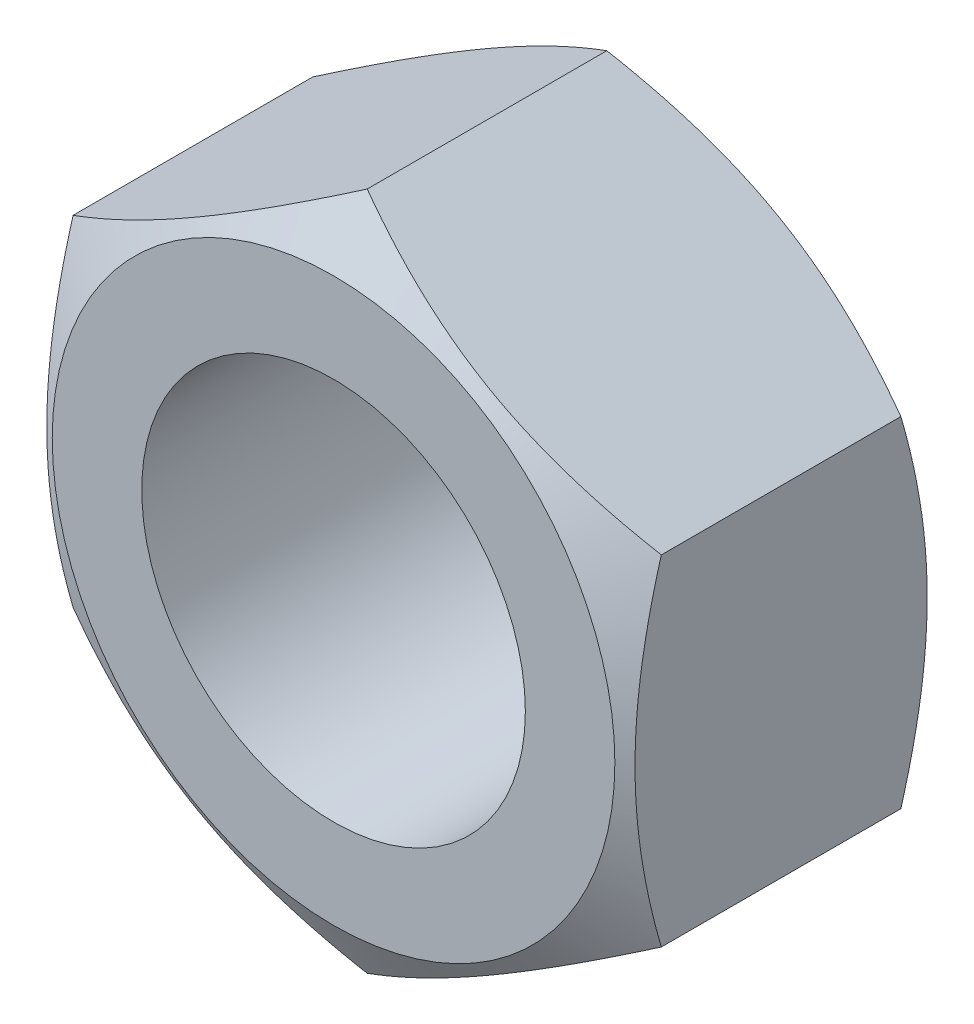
ISO-10303-21;
HEADER;
FILE_DESCRIPTION(('STEP AP214'),'2;1');
FILE_NAME('part.step','',(''),(''),'','','');
FILE_SCHEMA(('AUTOMOTIVE_DESIGN { 1 0 10303 214 1 1 1 1 }'));
ENDSEC;
DATA;
#1=APPLICATION_CONTEXT('core data for automotive mechanical design processes');
#2=APPLICATION_PROTOCOL_DEFINITION('international standard','automotive_design',2000,#1);
#3=PRODUCT_CONTEXT('',#1,'mechanical');
#4=PRODUCT('Part','Part','',(#3));
#5=PRODUCT_RELATED_PRODUCT_CATEGORY('part','',(#4));
#6=PRODUCT_DEFINITION_FORMATION('','',#4);
#7=PRODUCT_DEFINITION_CONTEXT('part definition',#1,'design');
#8=PRODUCT_DEFINITION('design','',#6,#7);
#9=PRODUCT_DEFINITION_SHAPE('','',#8);
#10=(LENGTH_UNIT() NAMED_UNIT(*) SI_UNIT(.MILLI.,.METRE.));
#11=(NAMED_UNIT(*) PLANE_ANGLE_UNIT() SI_UNIT($,.RADIAN.));
#12=(NAMED_UNIT(*) SI_UNIT($,.STERADIAN.) SOLID_ANGLE_UNIT());
#13=UNCERTAINTY_MEASURE_WITH_UNIT(LENGTH_MEASURE(1.E-05),#10,'distance_accuracy_value','');
#14=(GEOMETRIC_REPRESENTATION_CONTEXT(3) GLOBAL_UNCERTAINTY_ASSIGNED_CONTEXT((#13)) GLOBAL_UNIT_ASSIGNED_CONTEXT((#10,
#11,#12)) REPRESENTATION_CONTEXT('',''));
#15=CARTESIAN_POINT('',(0.,0.,0.));
#16=DIRECTION('',(0.,0.,1.));
#17=DIRECTION('',(1.,0.,0.));
#18=AXIS2_PLACEMENT_3D('',#15,#16,#17);
#19=CARTESIAN_POINT('',(23.,13.2790561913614,18.));
#20=DIRECTION('',(-0.5,-0.866025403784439,0.));
#21=DIRECTION('',(0.866025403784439,-0.5,0.));
#22=AXIS2_PLACEMENT_3D('',#19,#20,#21);
#23=PLANE('',#22);
#24=CARTESIAN_POINT('',(23.0002,13.2789407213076,21.368305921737));
#25=CARTESIAN_POINT('',(22.4946699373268,13.5708086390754,21.5368037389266));
#26=CARTESIAN_POINT('',(21.9871680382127,13.8638149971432,21.697655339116));
#27=CARTESIAN_POINT('',(20.9680946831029,14.4521772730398,22.0019407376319));
#28=CARTESIAN_POINT('',(20.4565219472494,14.7475339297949,22.1453688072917));
#29=CARTESIAN_POINT('',(19.4283073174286,15.3411739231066,22.4128820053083));
#30=CARTESIAN_POINT('',(18.9116563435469,15.6394625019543,22.5369209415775));
#31=CARTESIAN_POINT('',(17.874786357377,16.2380996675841,22.7629837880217));
#32=CARTESIAN_POINT('',(17.3545677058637,16.5384480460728,22.8650098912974));
#33=CARTESIAN_POINT('',(16.3238595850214,17.133527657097,23.0427162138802));
#34=CARTESIAN_POINT('',(15.8134465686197,17.4282147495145,23.1189841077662));
#35=CARTESIAN_POINT('',(14.7902817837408,18.0189392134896,23.2468679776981));
#36=CARTESIAN_POINT('',(14.2775299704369,18.3149766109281,23.2984834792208));
#37=CARTESIAN_POINT('',(13.2511650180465,18.9075486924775,23.3757592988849));
#38=CARTESIAN_POINT('',(12.737553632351,19.2040823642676,23.4014504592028));
#39=CARTESIAN_POINT('',(11.709856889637,19.7974233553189,23.4263251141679));
#40=CARTESIAN_POINT('',(11.1957715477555,20.0942306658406,23.4255094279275));
#41=CARTESIAN_POINT('',(10.2346805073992,20.649116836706,23.3992217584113));
#42=CARTESIAN_POINT('',(9.78760635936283,20.9072352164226,23.3769553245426));
#43=CARTESIAN_POINT('',(8.89452539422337,21.422855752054,23.3127980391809));
#44=CARTESIAN_POINT('',(8.44851856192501,21.6803579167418,23.2709074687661));
#45=CARTESIAN_POINT('',(7.55773701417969,22.1946508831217,23.1682279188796));
#46=CARTESIAN_POINT('',(7.11296378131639,22.4514408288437,23.1074218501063));
#47=CARTESIAN_POINT('',(6.22554696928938,22.9637911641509,22.9679874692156));
#48=CARTESIAN_POINT('',(5.78290338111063,23.219351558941,22.8893592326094));
#49=CARTESIAN_POINT('',(4.43913170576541,23.9951784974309,22.6247233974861));
#50=CARTESIAN_POINT('',(3.54182151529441,24.513240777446,22.4123142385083));
#51=CARTESIAN_POINT('',(2.20576568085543,25.2846129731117,22.050697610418));
#52=CARTESIAN_POINT('',(1.76244815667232,25.5405624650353,21.9231217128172));
#53=CARTESIAN_POINT('',(0.878879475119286,26.0506910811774,21.6550544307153));
#54=CARTESIAN_POINT('',(0.438627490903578,26.3048706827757,21.5145666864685));
#55=CARTESIAN_POINT('',(-0.000200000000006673,26.5582278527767,21.368305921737));
#56=B_SPLINE_CURVE_WITH_KNOTS('',3,(#24,#25,#26,#27,#28,#29,#30,#31,#32,#33,#34,#35,#36,#37,#38,
#39,#40,#41,#42,#43,#44,#45,#46,#47,#48,#49,#50,#51,#52,#53,#54,#55),.UNSPECIFIED.,.F.,.F.,(4,2,
2,2,2,2,2,2,2,2,2,2,2,2,2,4),(0.,1.82275209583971,3.64610187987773,5.47373144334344,
7.30117883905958,9.08355891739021,10.8659733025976,12.6462646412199,14.4265009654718,
15.9762768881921,17.5260306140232,19.0771885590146,20.6283399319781,23.7989683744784,
25.381520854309,26.9636285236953),.UNSPECIFIED.);
#57=CARTESIAN_POINT('',(23.,13.2790561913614,21.3683725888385));
#58=VERTEX_POINT('',#57);
#59=CARTESIAN_POINT('',(0.,26.5581123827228,21.3683725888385));
#60=VERTEX_POINT('',#59);
#61=EDGE_CURVE('E74',#58,#60,#56,.T.);
#62=ORIENTED_EDGE('',*,*,#61,.F.);
#63=DIRECTION('',(0.,0.,-1.));
#64=VECTOR('',#63,1.);
#65=CARTESIAN_POINT('',(23.,13.2790561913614,18.));
#66=LINE('',#65,#64);
#67=CARTESIAN_POINT('',(23.,13.2790561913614,2.63162741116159));
#68=VERTEX_POINT('',#67);
#69=EDGE_CURVE('E43',#58,#68,#66,.T.);
#70=ORIENTED_EDGE('',*,*,#69,.T.);
#71=CARTESIAN_POINT('',(41.5855022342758,2.54871147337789,11.3527456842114));
#72=CARTESIAN_POINT('',(41.1450502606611,2.80300653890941,11.1079162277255));
#73=CARTESIAN_POINT('',(40.7040475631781,3.05761956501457,10.8644035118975));
#74=CARTESIAN_POINT('',(39.8208235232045,3.56754920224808,10.3803276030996));
#75=CARTESIAN_POINT('',(39.3786021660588,3.82286582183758,10.1397644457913));
#76=CARTESIAN_POINT('',(38.4927512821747,4.33431206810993,9.66186486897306));
#77=CARTESIAN_POINT('',(38.0491215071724,4.59044183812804,9.42452906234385));
#78=CARTESIAN_POINT('',(37.1604115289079,5.10353878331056,8.95351300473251));
#79=CARTESIAN_POINT('',(36.7153313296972,5.36050595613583,8.71983274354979));
#80=CARTESIAN_POINT('',(35.372054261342,6.13604733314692,8.02195758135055));
#81=CARTESIAN_POINT('',(34.4714270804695,6.65602467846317,7.5639652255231));
#82=CARTESIAN_POINT('',(32.6624925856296,7.70041349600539,6.66876168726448));
#83=CARTESIAN_POINT('',(31.75418571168,8.22482471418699,6.23154932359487));
#84=CARTESIAN_POINT('',(29.9202973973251,9.2836206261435,5.37984431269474));
#85=CARTESIAN_POINT('',(28.9946343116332,9.8180524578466,4.96558472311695));
#86=CARTESIAN_POINT('',(27.1320311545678,10.8934268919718,4.17164593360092));
#87=CARTESIAN_POINT('',(26.1950897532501,11.4343702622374,3.79197085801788));
#88=CARTESIAN_POINT('',(24.3106706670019,12.5223401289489,3.07821746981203));
#89=CARTESIAN_POINT('',(23.3632239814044,13.0693487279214,2.74403099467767));
#90=CARTESIAN_POINT('',(21.454635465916,14.1712728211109,2.13286972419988));
#91=CARTESIAN_POINT('',(20.4934985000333,14.7261855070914,1.85587512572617));
#92=CARTESIAN_POINT('',(19.0482059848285,15.5606255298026,1.49577894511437));
#93=CARTESIAN_POINT('',(18.5690812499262,15.8372483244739,1.38554003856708));
#94=CARTESIAN_POINT('',(17.6077970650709,16.3922460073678,1.18429026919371));
#95=CARTESIAN_POINT('',(17.1256376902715,16.6706208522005,1.09327893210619));
#96=CARTESIAN_POINT('',(16.158656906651,17.228907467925,0.932140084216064));
#97=CARTESIAN_POINT('',(15.673835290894,17.5088193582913,0.862014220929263));
#98=CARTESIAN_POINT('',(14.7021451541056,18.0698249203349,0.744079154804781));
#99=CARTESIAN_POINT('',(14.2152766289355,18.3509185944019,0.696269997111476));
#100=CARTESIAN_POINT('',(13.2429233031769,18.9123070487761,0.624219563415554));
#101=CARTESIAN_POINT('',(12.7574456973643,19.1925976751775,0.599849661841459));
#102=CARTESIAN_POINT('',(11.7860363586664,19.7534411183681,0.574777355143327));
#103=CARTESIAN_POINT('',(11.300104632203,20.0339939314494,0.574074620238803));
#104=CARTESIAN_POINT('',(10.3287659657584,20.5947965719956,0.596351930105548));
#105=CARTESIAN_POINT('',(9.84335892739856,20.8750464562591,0.619326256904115));
#106=CARTESIAN_POINT('',(8.87377970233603,21.4348332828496,0.68841563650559));
#107=CARTESIAN_POINT('',(8.38960757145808,21.7143701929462,0.734531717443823));
#108=CARTESIAN_POINT('',(7.19256304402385,22.4054841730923,0.876233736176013));
#109=CARTESIAN_POINT('',(6.48083681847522,22.8163995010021,0.98492575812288));
#110=CARTESIAN_POINT('',(5.06341935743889,23.6347458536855,1.24605374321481));
#111=CARTESIAN_POINT('',(4.35772914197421,24.0421762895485,1.39849695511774));
#112=CARTESIAN_POINT('',(2.95186459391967,24.8538525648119,1.74192763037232));
#113=CARTESIAN_POINT('',(2.2517057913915,25.2580894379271,1.93299906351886));
#114=CARTESIAN_POINT('',(0.858781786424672,26.0622944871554,2.34779891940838));
#115=CARTESIAN_POINT('',(0.166016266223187,26.462262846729,2.57152593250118));
#116=CARTESIAN_POINT('',(-1.2274955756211,27.2668072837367,3.05160724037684));
#117=CARTESIAN_POINT('',(-1.92808377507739,27.6712920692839,3.30856942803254));
#118=CARTESIAN_POINT('',(-3.32240533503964,28.476303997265,3.84627513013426));
#119=CARTESIAN_POINT('',(-4.01613810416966,28.8768307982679,4.1270206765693));
#120=CARTESIAN_POINT('',(-5.39338581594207,29.6719851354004,4.70650160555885));
#121=CARTESIAN_POINT('',(-6.0769366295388,30.0666333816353,5.00512373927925));
#122=CARTESIAN_POINT('',(-7.09804291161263,30.6561693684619,5.46510621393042));
#123=CARTESIAN_POINT('',(-7.43765669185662,30.8522454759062,5.62041722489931));
#124=CARTESIAN_POINT('',(-8.11559292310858,31.2436521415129,5.93472462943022));
#125=CARTESIAN_POINT('',(-8.45391540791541,31.4389827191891,6.093720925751));
#126=CARTESIAN_POINT('',(-8.79164107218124,31.6339687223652,6.2543918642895));
#127=B_SPLINE_CURVE_WITH_KNOTS('',3,(#71,#72,#73,#74,#75,#76,#77,#78,#79,#80,#81,#82,#83,#84,
#85,#86,#87,#88,#89,#90,#91,#92,#93,#94,#95,#96,#97,#98,#99,#100,#101,#102,#103,#104,#105,#106,
#107,#108,#109,#110,#111,#112,#113,#114,#115,#116,#117,#118,#119,#120,#121,#122,#123,#124,#125,
#126),.UNSPECIFIED.,.F.,.F.,(4,2,2,2,2,2,2,2,2,2,2,2,2,2,2,2,2,2,2,2,2,2,2,2,2,2,2,4),(0.,
1.69335491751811,3.38673028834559,5.08042286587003,6.7741107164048,10.1829354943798,
13.5915662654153,17.0301107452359,20.4690647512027,23.8996931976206,27.3291317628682,
29.0212168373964,30.71326017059,32.4054369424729,34.0976171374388,35.7804574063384,
37.4632742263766,39.1456847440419,40.8281700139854,43.313727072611,45.7996961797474,
48.2911285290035,50.7824533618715,53.3284099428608,55.8745842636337,58.4060550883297,
59.6714032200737,60.9367180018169),.UNSPECIFIED.);
#128=CARTESIAN_POINT('',(0.,26.5581123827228,2.63162741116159));
#129=VERTEX_POINT('',#128);
#130=EDGE_CURVE('E92',#129,#68,#127,.F.);
#131=ORIENTED_EDGE('',*,*,#130,.F.);
#132=DIRECTION('',(0.,0.,-1.));
#133=VECTOR('',#132,1.);
#134=CARTESIAN_POINT('',(0.,26.5581123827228,18.));
#135=LINE('',#134,#133);
#136=EDGE_CURVE('E28',#60,#129,#135,.T.);
#137=ORIENTED_EDGE('',*,*,#136,.F.);
#138=EDGE_LOOP('',(#62,#70,#131,#137));
#139=FACE_BOUND('',#138,.T.);
#140=ADVANCED_FACE('F14',(#139),#23,.F.);
#141=CARTESIAN_POINT('',(0.,26.5581123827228,18.));
#142=DIRECTION('',(0.5,-0.866025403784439,0.));
#143=DIRECTION('',(0.866025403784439,0.5,0.));
#144=AXIS2_PLACEMENT_3D('',#141,#142,#143);
#145=PLANE('',#144);
#146=CARTESIAN_POINT('',(0.000199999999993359,26.5582278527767,21.368305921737));
#147=CARTESIAN_POINT('',(-0.505330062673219,26.2663599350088,21.5368037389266));
#148=CARTESIAN_POINT('',(-1.01283196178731,25.973353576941,21.697655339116));
#149=CARTESIAN_POINT('',(-2.03190531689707,25.3849913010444,22.0019407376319));
#150=CARTESIAN_POINT('',(-2.54347805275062,25.0896346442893,22.1453688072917));
#151=CARTESIAN_POINT('',(-3.57169268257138,24.4959946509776,22.4128820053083));
#152=CARTESIAN_POINT('',(-4.08834365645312,24.1977060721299,22.5369209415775));
#153=CARTESIAN_POINT('',(-5.12521364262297,23.5990689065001,22.7629837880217));
#154=CARTESIAN_POINT('',(-5.64543229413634,23.2987205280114,22.8650098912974));
#155=CARTESIAN_POINT('',(-6.6761404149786,22.7036409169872,23.0427162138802));
#156=CARTESIAN_POINT('',(-7.18655343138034,22.4089538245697,23.1189841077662));
#157=CARTESIAN_POINT('',(-8.20971821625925,21.8182293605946,23.2468679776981));
#158=CARTESIAN_POINT('',(-8.72247002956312,21.5221919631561,23.2984834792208));
#159=CARTESIAN_POINT('',(-9.74883498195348,20.9296198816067,23.3757592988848));
#160=CARTESIAN_POINT('',(-10.262446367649,20.6330862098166,23.4014504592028));
#161=CARTESIAN_POINT('',(-11.290143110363,20.0397452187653,23.4263251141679));
#162=CARTESIAN_POINT('',(-11.8042284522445,19.7429379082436,23.4255094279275));
#163=CARTESIAN_POINT('',(-12.7653194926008,19.1880517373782,23.3992217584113));
#164=CARTESIAN_POINT('',(-13.2123936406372,18.9299333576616,23.3769553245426));
#165=CARTESIAN_POINT('',(-14.1054746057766,18.4143128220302,23.3127980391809));
#166=CARTESIAN_POINT('',(-14.551481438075,18.1568106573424,23.2709074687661));
#167=CARTESIAN_POINT('',(-15.4422629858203,17.6425176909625,23.1682279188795));
#168=CARTESIAN_POINT('',(-15.8870362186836,17.3857277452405,23.1074218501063));
#169=CARTESIAN_POINT('',(-16.7744530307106,16.8733774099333,22.9679874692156));
#170=CARTESIAN_POINT('',(-17.2170966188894,16.6178170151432,22.8893592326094));
#171=CARTESIAN_POINT('',(-18.5608682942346,15.8419900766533,22.6247233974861));
#172=CARTESIAN_POINT('',(-19.4581784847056,15.3239277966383,22.4123142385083));
#173=CARTESIAN_POINT('',(-20.7942343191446,14.5525556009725,22.050697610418));
#174=CARTESIAN_POINT('',(-21.2375518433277,14.2966061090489,21.9231217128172));
#175=CARTESIAN_POINT('',(-22.1211205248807,13.7864774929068,21.6550544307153));
#176=CARTESIAN_POINT('',(-22.5613725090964,13.5322978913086,21.5145666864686));
#177=CARTESIAN_POINT('',(-23.0002,13.2789407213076,21.368305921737));
#178=B_SPLINE_CURVE_WITH_KNOTS('',3,(#146,#147,#148,#149,#150,#151,#152,#153,#154,#155,#156,
#157,#158,#159,#160,#161,#162,#163,#164,#165,#166,#167,#168,#169,#170,#171,#172,#173,#174,#175,
#176,#177),.UNSPECIFIED.,.F.,.F.,(4,2,2,2,2,2,2,2,2,2,2,2,2,2,2,4),(0.,1.82275209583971,
3.64610187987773,5.47373144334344,7.30117883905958,9.08355891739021,10.8659733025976,
12.6462646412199,14.4265009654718,15.9762768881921,17.5260306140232,19.0771885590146,
20.6283399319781,23.7989683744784,25.381520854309,26.9636285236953),.UNSPECIFIED.);
#179=CARTESIAN_POINT('',(-23.,13.2790561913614,21.3683725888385));
#180=VERTEX_POINT('',#179);
#181=EDGE_CURVE('E82',#60,#180,#178,.T.);
#182=ORIENTED_EDGE('',*,*,#181,.F.);
#183=ORIENTED_EDGE('',*,*,#136,.T.);
#184=CARTESIAN_POINT('',(-23.8320518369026,12.798670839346,2.91636768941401));
#185=CARTESIAN_POINT('',(-23.2953065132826,13.1085608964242,2.72803249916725));
#186=CARTESIAN_POINT('',(-22.7563664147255,13.4197181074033,2.5477624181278));
#187=CARTESIAN_POINT('',(-21.673799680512,14.0447383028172,2.20583721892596));
#188=CARTESIAN_POINT('',(-21.1301708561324,14.358602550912,2.04419136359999));
#189=CARTESIAN_POINT('',(-20.0367752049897,14.98987482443,1.74172458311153));
#190=CARTESIAN_POINT('',(-19.4869946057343,15.3072908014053,1.60096952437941));
#191=CARTESIAN_POINT('',(-18.3833065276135,15.9445054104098,1.34366074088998));
#192=CARTESIAN_POINT('',(-17.8294000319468,16.2643034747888,1.2271014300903));
#193=CARTESIAN_POINT('',(-16.7337868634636,16.8968560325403,1.02375745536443));
#194=CARTESIAN_POINT('',(-16.1921865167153,17.2095491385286,0.936214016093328));
#195=CARTESIAN_POINT('',(-15.106158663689,17.8365676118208,0.788568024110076));
#196=CARTESIAN_POINT('',(-14.5617311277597,18.1508929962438,0.728465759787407));
#197=CARTESIAN_POINT('',(-13.4719184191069,18.7800966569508,0.637405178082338));
#198=CARTESIAN_POINT('',(-12.9265362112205,19.0949732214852,0.606399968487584));
#199=CARTESIAN_POINT('',(-11.8351086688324,19.725109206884,0.574255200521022));
#200=CARTESIAN_POINT('',(-11.2890633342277,20.0403686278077,0.573115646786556));
#201=CARTESIAN_POINT('',(-10.1630349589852,20.6904814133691,0.601615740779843));
#202=CARTESIAN_POINT('',(-9.58308858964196,21.025313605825,0.633205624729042));
#203=CARTESIAN_POINT('',(-8.42523880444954,21.693798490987,0.729171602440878));
#204=CARTESIAN_POINT('',(-7.84733545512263,22.0274511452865,0.793548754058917));
#205=CARTESIAN_POINT('',(-6.69364792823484,22.6935329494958,0.953279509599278));
#206=CARTESIAN_POINT('',(-6.11786997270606,23.0259585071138,1.04869251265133));
#207=CARTESIAN_POINT('',(-4.97041246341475,23.6884434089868,1.26783644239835));
#208=CARTESIAN_POINT('',(-4.3987328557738,24.0185027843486,1.39156699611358));
#209=CARTESIAN_POINT('',(-3.24174761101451,24.6864885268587,1.66875672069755));
#210=CARTESIAN_POINT('',(-2.65659107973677,25.02432880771,1.82304025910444));
#211=CARTESIAN_POINT('',(-1.49131947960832,25.6970986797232,2.15533572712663));
#212=CARTESIAN_POINT('',(-0.911204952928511,26.0320279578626,2.33335017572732));
#213=CARTESIAN_POINT('',(0.241570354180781,26.6975830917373,2.70914788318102));
#214=CARTESIAN_POINT('',(0.814252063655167,27.0282210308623,2.90684614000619));
#215=CARTESIAN_POINT('',(1.95462450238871,27.6866153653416,3.31979101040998));
#216=CARTESIAN_POINT('',(2.52231703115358,28.0143727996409,3.53503098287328));
#217=CARTESIAN_POINT('',(3.08774403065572,28.3408222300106,3.75770240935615));
#218=B_SPLINE_CURVE_WITH_KNOTS('',3,(#184,#185,#186,#187,#188,#189,#190,#191,#192,#193,#194,
#195,#196,#197,#198,#199,#200,#201,#202,#203,#204,#205,#206,#207,#208,#209,#210,#211,#212,#213,
#214,#215,#216,#217),.UNSPECIFIED.,.F.,.F.,(4,2,2,2,2,2,2,2,2,2,2,2,2,2,2,2,4),(0.,
1.9433546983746,3.88767179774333,5.83799451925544,7.78786647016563,9.68175583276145,
11.5756650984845,13.4665169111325,15.3573690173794,17.3677498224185,19.3781954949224,
21.3925117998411,23.4068015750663,25.485525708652,27.564470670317,29.6347982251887,
31.7043455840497),.UNSPECIFIED.);
#219=CARTESIAN_POINT('',(-23.,13.2790561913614,2.63162741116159));
#220=VERTEX_POINT('',#219);
#221=EDGE_CURVE('E105',#220,#129,#218,.T.);
#222=ORIENTED_EDGE('',*,*,#221,.F.);
#223=DIRECTION('',(0.,0.,-1.));
#224=VECTOR('',#223,1.);
#225=CARTESIAN_POINT('',(-23.,13.2790561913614,18.));
#226=LINE('',#225,#224);
#227=EDGE_CURVE('E99',#180,#220,#226,.T.);
#228=ORIENTED_EDGE('',*,*,#227,.F.);
#229=EDGE_LOOP('',(#182,#183,#222,#228));
#230=FACE_BOUND('',#229,.T.);
#231=ADVANCED_FACE('F103',(#230),#145,.F.);
#232=CARTESIAN_POINT('',(-23.,13.2790561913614,18.));
#233=DIRECTION('',(1.,0.,0.));
#234=DIRECTION('',(0.,1.,0.));
#235=AXIS2_PLACEMENT_3D('',#232,#233,#234);
#236=PLANE('',#235);
#237=CARTESIAN_POINT('',(-23.,-35.435829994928,12.3111473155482));
#238=CARTESIAN_POINT('',(-23.,-34.9345288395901,12.5539120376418));
#239=CARTESIAN_POINT('',(-23.,-34.4326326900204,12.7954518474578));
#240=CARTESIAN_POINT('',(-23.,-33.4275269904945,13.2757959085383));
#241=CARTESIAN_POINT('',(-23.,-32.9243174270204,13.5146001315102));
#242=CARTESIAN_POINT('',(-23.,-31.9163920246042,13.9892198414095));
#243=CARTESIAN_POINT('',(-23.,-31.4116759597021,14.2250348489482));
#244=CARTESIAN_POINT('',(-23.,-30.4006845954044,14.6932936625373));
#245=CARTESIAN_POINT('',(-23.,-29.8944092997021,14.9257374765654));
#246=CARTESIAN_POINT('',(-23.,-28.3673829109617,15.6200193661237));
#247=CARTESIAN_POINT('',(-23.,-27.3440309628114,16.0761611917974));
#248=CARTESIAN_POINT('',(-23.,-25.2891020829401,16.969489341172));
#249=CARTESIAN_POINT('',(-23.,-24.2575255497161,17.4066765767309));
#250=CARTESIAN_POINT('',(-23.,-22.6865874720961,18.0510551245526));
#251=CARTESIAN_POINT('',(-23.,-22.1508440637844,18.2670754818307));
#252=CARTESIAN_POINT('',(-23.,-21.0764871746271,18.6918481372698));
#253=CARTESIAN_POINT('',(-23.,-20.5378737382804,18.9006005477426));
#254=CARTESIAN_POINT('',(-23.,-19.457438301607,19.3098906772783));
#255=CARTESIAN_POINT('',(-23.,-18.9156158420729,19.5104271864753));
#256=CARTESIAN_POINT('',(-23.,-17.8285986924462,19.9021167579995));
#257=CARTESIAN_POINT('',(-23.,-17.2834040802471,20.0932700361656));
#258=CARTESIAN_POINT('',(-23.,-16.1905158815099,20.4645265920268));
#259=CARTESIAN_POINT('',(-23.,-15.6428298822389,20.6446520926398));
#260=CARTESIAN_POINT('',(-23.,-14.5436440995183,20.9928282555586));
#261=CARTESIAN_POINT('',(-23.,-13.9921442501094,21.1608787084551));
#262=CARTESIAN_POINT('',(-23.,-12.3319137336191,21.6444535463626));
#263=CARTESIAN_POINT('',(-23.,-11.2170274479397,21.9395481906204));
#264=CARTESIAN_POINT('',(-23.,-9.53574528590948,22.3296350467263));
#265=CARTESIAN_POINT('',(-23.,-8.97532213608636,22.4506531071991));
#266=CARTESIAN_POINT('',(-23.,-7.85068621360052,22.6737054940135));
#267=CARTESIAN_POINT('',(-23.,-7.28647352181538,22.7757402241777));
#268=CARTESIAN_POINT('',(-23.,-6.15468027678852,22.9590093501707));
#269=CARTESIAN_POINT('',(-23.,-5.5870998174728,23.0402443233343));
#270=CARTESIAN_POINT('',(-23.,-4.44915935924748,23.1802899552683));
#271=CARTESIAN_POINT('',(-23.,-3.87879936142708,23.2391006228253));
#272=CARTESIAN_POINT('',(-23.,-2.74347299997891,23.3323996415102));
#273=CARTESIAN_POINT('',(-23.,-2.17853171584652,23.3671913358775));
#274=CARTESIAN_POINT('',(-23.,-1.0476861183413,23.4128693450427));
#275=CARTESIAN_POINT('',(-23.,-0.481781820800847,23.4237560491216));
#276=CARTESIAN_POINT('',(-23.,0.649983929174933,23.4213658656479));
#277=CARTESIAN_POINT('',(-23.,1.21584538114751,23.4080887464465));
#278=CARTESIAN_POINT('',(-23.,2.34651090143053,23.3576906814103));
#279=CARTESIAN_POINT('',(-23.,2.91131492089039,23.3205686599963));
#280=CARTESIAN_POINT('',(-23.,4.27585254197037,23.202857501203));
#281=CARTESIAN_POINT('',(-23.,5.07459325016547,23.110558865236));
#282=CARTESIAN_POINT('',(-23.,6.66599654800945,22.8833567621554));
#283=CARTESIAN_POINT('',(-23.,7.45865826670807,22.7484473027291));
#284=CARTESIAN_POINT('',(-23.,9.03719924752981,22.4408232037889));
#285=CARTESIAN_POINT('',(-23.,9.82307257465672,22.2680783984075));
#286=CARTESIAN_POINT('',(-23.,11.3868632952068,21.8900410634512));
#287=CARTESIAN_POINT('',(-23.,12.1647808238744,21.6847490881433));
#288=CARTESIAN_POINT('',(-23.,13.7296474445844,21.2417797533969));
#289=CARTESIAN_POINT('',(-23.,14.5164228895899,21.0034931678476));
#290=CARTESIAN_POINT('',(-23.,16.0822208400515,20.5028080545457));
#291=CARTESIAN_POINT('',(-23.,16.8612432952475,20.2404093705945));
#292=CARTESIAN_POINT('',(-23.,18.4119293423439,19.6956218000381));
#293=CARTESIAN_POINT('',(-23.,19.1835953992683,19.4132398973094));
#294=CARTESIAN_POINT('',(-23.,20.720567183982,18.8317581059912));
#295=CARTESIAN_POINT('',(-23.,21.4858729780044,18.532658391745));
#296=CARTESIAN_POINT('',(-23.,23.2575202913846,17.821509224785));
#297=CARTESIAN_POINT('',(-23.,24.2617547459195,17.4042191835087));
#298=CARTESIAN_POINT('',(-23.,26.2619856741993,16.5502875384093));
#299=CARTESIAN_POINT('',(-23.,27.2579816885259,16.1136448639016));
#300=CARTESIAN_POINT('',(-23.,29.2432265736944,15.2247913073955));
#301=CARTESIAN_POINT('',(-23.,30.2324740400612,14.7725772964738));
#302=CARTESIAN_POINT('',(-23.,32.2051196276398,13.8556438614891));
#303=CARTESIAN_POINT('',(-23.,33.1885178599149,13.3909246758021));
#304=CARTESIAN_POINT('',(-23.,35.1514088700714,12.4507883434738));
#305=CARTESIAN_POINT('',(-23.,36.1308966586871,11.9753607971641));
#306=CARTESIAN_POINT('',(-23.,38.085725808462,11.0160582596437));
#307=CARTESIAN_POINT('',(-23.,39.0610671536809,10.5321832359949));
#308=CARTESIAN_POINT('',(-23.,41.0081159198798,9.55745903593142));
#309=CARTESIAN_POINT('',(-23.,41.9798237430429,9.0666106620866));
#310=CARTESIAN_POINT('',(-23.,43.9202271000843,8.07900547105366));
#311=CARTESIAN_POINT('',(-23.,44.8889226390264,7.58224866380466));
#312=CARTESIAN_POINT('',(-23.,47.6347011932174,6.16524180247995));
#313=CARTESIAN_POINT('',(-23.,49.4087246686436,5.23906312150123));
#314=CARTESIAN_POINT('',(-23.,52.9501704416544,3.37406290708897));
#315=CARTESIAN_POINT('',(-23.,54.7175925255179,2.4352409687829));
#316=CARTESIAN_POINT('',(-23.,58.2431212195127,0.550079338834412));
#317=CARTESIAN_POINT('',(-23.,60.0012399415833,-0.396237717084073));
#318=CARTESIAN_POINT('',(-23.,62.6352870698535,-1.82138569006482));
#319=CARTESIAN_POINT('',(-23.,63.5127588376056,-2.29736832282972));
#320=CARTESIAN_POINT('',(-23.,65.2667746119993,-3.25103685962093));
#321=CARTESIAN_POINT('',(-23.,66.1433186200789,-3.7287227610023));
#322=CARTESIAN_POINT('',(-23.,67.0194506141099,-4.20716337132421));
#323=B_SPLINE_CURVE_WITH_KNOTS('',3,(#237,#238,#239,#240,#241,#242,#243,#244,#245,#246,#247,
#248,#249,#250,#251,#252,#253,#254,#255,#256,#257,#258,#259,#260,#261,#262,#263,#264,#265,#266,
#267,#268,#269,#270,#271,#272,#273,#274,#275,#276,#277,#278,#279,#280,#281,#282,#283,#284,#285,
#286,#287,#288,#289,#290,#291,#292,#293,#294,#295,#296,#297,#298,#299,#300,#301,#302,#303,#304,
#305,#306,#307,#308,#309,#310,#311,#312,#313,#314,#315,#316,#317,#318,#319,#320,#321,#322),
.UNSPECIFIED.,.F.,.F.,(4,2,2,2,2,2,2,2,2,2,2,2,2,2,2,2,2,2,2,2,2,2,2,2,2,2,2,2,2,2,2,2,2,2,2,2,
2,2,2,2,2,2,4),(0.,1.67096983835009,3.3419569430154,5.0132087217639,6.68445654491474,
10.0455313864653,13.4064443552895,15.1393675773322,16.8722640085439,18.6054147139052,
20.3385255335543,22.0680203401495,23.797545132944,27.2552479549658,28.9750114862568,
30.6947384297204,32.4144176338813,34.1340961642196,35.8316381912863,37.5291525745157,
39.2266832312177,40.9242904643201,43.3351186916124,45.7462861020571,48.159382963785,
50.5724387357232,53.0381802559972,55.5039377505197,57.9688377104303,60.4337119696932,
63.6958871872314,66.958243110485,70.2212584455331,73.484211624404,76.7504833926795,
80.0167677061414,83.2826790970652,86.5485849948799,92.5522316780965,98.5560710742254,
104.545910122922,107.540678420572,110.535442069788),.UNSPECIFIED.);
#324=CARTESIAN_POINT('',(-23.,-13.2790561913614,21.3683725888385));
#325=VERTEX_POINT('',#324);
#326=EDGE_CURVE('E165',#180,#325,#323,.F.);
#327=ORIENTED_EDGE('',*,*,#326,.F.);
#328=ORIENTED_EDGE('',*,*,#227,.T.);
#329=CARTESIAN_POINT('',(-23.,-35.4106573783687,11.6766632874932));
#330=CARTESIAN_POINT('',(-23.,-34.9094587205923,11.4339993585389));
#331=CARTESIAN_POINT('',(-23.,-34.4076644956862,11.1925617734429));
#332=CARTESIAN_POINT('',(-23.,-33.4027613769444,10.7124254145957));
#333=CARTESIAN_POINT('',(-23.,-32.8996524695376,10.4737266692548));
#334=CARTESIAN_POINT('',(-23.,-31.891926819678,9.99932148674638));
#335=CARTESIAN_POINT('',(-23.,-31.3873098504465,9.76361553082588));
#336=CARTESIAN_POINT('',(-23.,-30.3765152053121,9.29557895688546));
#337=CARTESIAN_POINT('',(-23.,-29.870337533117,9.06324833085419));
#338=CARTESIAN_POINT('',(-23.,-28.3435895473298,8.36930828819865));
#339=CARTESIAN_POINT('',(-23.,-27.3204158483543,7.91340239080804));
#340=CARTESIAN_POINT('',(-23.,-25.2658359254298,7.02057072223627));
#341=CARTESIAN_POINT('',(-23.,-24.2344301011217,6.58364403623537));
#342=CARTESIAN_POINT('',(-23.,-22.6637960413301,5.93970548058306));
#343=CARTESIAN_POINT('',(-23.,-22.1281891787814,5.72385232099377));
#344=CARTESIAN_POINT('',(-23.,-21.0541037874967,5.29942214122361));
#345=CARTESIAN_POINT('',(-23.,-20.5156253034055,5.09084500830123));
#346=CARTESIAN_POINT('',(-23.,-19.4354582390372,4.68191441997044));
#347=CARTESIAN_POINT('',(-23.,-18.8937691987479,4.48156217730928));
#348=CARTESIAN_POINT('',(-23.,-17.8070177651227,4.09025108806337));
#349=CARTESIAN_POINT('',(-23.,-17.2619554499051,3.89929202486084));
#350=CARTESIAN_POINT('',(-23.,-16.169333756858,3.52843529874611));
#351=CARTESIAN_POINT('',(-23.,-15.621781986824,3.34851533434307));
#352=CARTESIAN_POINT('',(-23.,-14.5228648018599,3.00076157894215));
#353=CARTESIAN_POINT('',(-23.,-13.9714993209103,2.83292799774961));
#354=CARTESIAN_POINT('',(-23.,-12.3116738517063,2.35002166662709));
#355=CARTESIAN_POINT('',(-23.,-11.197059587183,2.05539646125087));
#356=CARTESIAN_POINT('',(-23.,-9.51618846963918,1.66604294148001));
#357=CARTESIAN_POINT('',(-23.,-8.955897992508,1.54527273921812));
#358=CARTESIAN_POINT('',(-23.,-7.83153323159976,1.32272528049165));
#359=CARTESIAN_POINT('',(-23.,-7.26745902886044,1.22094761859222));
#360=CARTESIAN_POINT('',(-23.,-6.13595020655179,1.03819874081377));
#361=CARTESIAN_POINT('',(-23.,-5.56851567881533,0.957226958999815));
#362=CARTESIAN_POINT('',(-23.,-4.43087659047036,0.817709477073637));
#363=CARTESIAN_POINT('',(-23.,-3.86067203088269,0.759163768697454));
#364=CARTESIAN_POINT('',(-23.,-2.7256524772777,0.666386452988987));
#365=CARTESIAN_POINT('',(-23.,-2.16086238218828,0.631852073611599));
#366=CARTESIAN_POINT('',(-23.,-1.03032999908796,0.586680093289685));
#367=CARTESIAN_POINT('',(-23.,-0.464587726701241,0.576042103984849));
#368=CARTESIAN_POINT('',(-23.,0.666843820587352,0.578915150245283));
#369=CARTESIAN_POINT('',(-23.,1.23253309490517,0.592426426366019));
#370=CARTESIAN_POINT('',(-23.,2.3628452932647,0.643272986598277));
#371=CARTESIAN_POINT('',(-23.,2.9274681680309,0.680609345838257));
#372=CARTESIAN_POINT('',(-23.,4.2923522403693,0.798879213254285));
#373=CARTESIAN_POINT('',(-23.,5.09161314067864,0.891556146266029));
#374=CARTESIAN_POINT('',(-23.,6.68403609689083,1.11954103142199));
#375=CARTESIAN_POINT('',(-23.,7.47719727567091,1.25485500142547));
#376=CARTESIAN_POINT('',(-23.,9.05672186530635,1.5632998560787));
#377=CARTESIAN_POINT('',(-23.,9.8430793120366,1.73646099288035));
#378=CARTESIAN_POINT('',(-23.,11.4078253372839,2.1153315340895));
#379=CARTESIAN_POINT('',(-23.,12.1862140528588,2.3210403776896));
#380=CARTESIAN_POINT('',(-23.,13.752002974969,2.76484032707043));
#381=CARTESIAN_POINT('',(-23.,14.5392295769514,3.00353973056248));
#382=CARTESIAN_POINT('',(-23.,16.1059252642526,3.50503945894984));
#383=CARTESIAN_POINT('',(-23.,16.885394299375,3.76783993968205));
#384=CARTESIAN_POINT('',(-23.,18.4369700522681,4.31341845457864));
#385=CARTESIAN_POINT('',(-23.,19.2090792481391,4.596189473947));
#386=CARTESIAN_POINT('',(-23.,20.7469373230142,5.17843757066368));
#387=CARTESIAN_POINT('',(-23.,21.5126862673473,5.47791447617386));
#388=CARTESIAN_POINT('',(-23.,23.2813886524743,6.18833070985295));
#389=CARTESIAN_POINT('',(-23.,24.2822738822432,6.60441065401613));
#390=CARTESIAN_POINT('',(-23.,26.2758679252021,7.45577128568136));
#391=CARTESIAN_POINT('',(-23.,27.2685762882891,7.89105302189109));
#392=CARTESIAN_POINT('',(-23.,29.2472910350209,8.77707444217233));
#393=CARTESIAN_POINT('',(-23.,30.2332960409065,9.22781719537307));
#394=CARTESIAN_POINT('',(-23.,32.1994942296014,10.1417289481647));
#395=CARTESIAN_POINT('',(-23.,33.1796875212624,10.6048977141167));
#396=CARTESIAN_POINT('',(-23.,35.1361852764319,11.5418691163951));
#397=CARTESIAN_POINT('',(-23.,36.112484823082,12.0156820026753));
#398=CARTESIAN_POINT('',(-23.,38.0609595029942,12.9717116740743));
#399=CARTESIAN_POINT('',(-23.,39.0331346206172,13.4539284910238));
#400=CARTESIAN_POINT('',(-23.,40.9738696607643,14.4253045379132));
#401=CARTESIAN_POINT('',(-23.,41.9424299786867,14.9144629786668));
#402=CARTESIAN_POINT('',(-23.,43.8765515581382,15.8986636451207));
#403=CARTESIAN_POINT('',(-23.,44.8421128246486,16.3937058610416));
#404=CARTESIAN_POINT('',(-23.,47.579699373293,17.8061755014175));
#405=CARTESIAN_POINT('',(-23.,49.3486738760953,18.7295158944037));
#406=CARTESIAN_POINT('',(-23.,52.8800382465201,20.5888089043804));
#407=CARTESIAN_POINT('',(-23.,54.6424279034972,21.5247619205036));
#408=CARTESIAN_POINT('',(-23.,58.1579458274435,23.4041903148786));
#409=CARTESIAN_POINT('',(-23.,59.9110860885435,24.3476432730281));
#410=CARTESIAN_POINT('',(-23.,62.5376712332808,25.768486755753));
#411=CARTESIAN_POINT('',(-23.,63.4126568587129,26.2430332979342));
#412=CARTESIAN_POINT('',(-23.,65.1617017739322,27.1938273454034));
#413=CARTESIAN_POINT('',(-23.,66.0357610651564,27.6700748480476));
#414=CARTESIAN_POINT('',(-23.,66.9094088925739,28.1470761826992));
#415=B_SPLINE_CURVE_WITH_KNOTS('',3,(#329,#330,#331,#332,#333,#334,#335,#336,#337,#338,#339,
#340,#341,#342,#343,#344,#345,#346,#347,#348,#349,#350,#351,#352,#353,#354,#355,#356,#357,#358,
#359,#360,#361,#362,#363,#364,#365,#366,#367,#368,#369,#370,#371,#372,#373,#374,#375,#376,#377,
#378,#379,#380,#381,#382,#383,#384,#385,#386,#387,#388,#389,#390,#391,#392,#393,#394,#395,#396,
#397,#398,#399,#400,#401,#402,#403,#404,#405,#406,#407,#408,#409,#410,#411,#412,#413,#414),
.UNSPECIFIED.,.F.,.F.,(4,2,2,2,2,2,2,2,2,2,2,2,2,2,2,2,2,2,2,2,2,2,2,2,2,2,2,2,2,2,2,2,2,2,2,2,
2,2,2,2,2,2,4),(0.,1.67056130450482,3.34113992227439,5.01198385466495,6.68282382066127,
10.0431217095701,13.4032574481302,15.1356131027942,16.8679419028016,18.6005252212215,
20.3330685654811,22.0619879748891,23.7909373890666,27.2474876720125,28.9667050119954,
30.6858856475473,32.4050195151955,34.1241527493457,35.8211948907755,37.5182094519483,
39.2152409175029,40.9123489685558,43.3248564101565,45.7377045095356,48.1524883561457,
50.5672305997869,53.0346271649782,55.5020396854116,57.9685897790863,60.4351145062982,
63.6866220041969,66.9383073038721,70.1906418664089,73.4429153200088,76.698467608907,
79.9540322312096,83.2092296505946,86.4644216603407,92.4507007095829,98.4371696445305,
104.409785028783,107.39594310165,110.38209653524),.UNSPECIFIED.);
#416=CARTESIAN_POINT('',(-23.,-13.2790561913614,2.63162741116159));
#417=VERTEX_POINT('',#416);
#418=EDGE_CURVE('E111',#417,#220,#415,.T.);
#419=ORIENTED_EDGE('',*,*,#418,.F.);
#420=DIRECTION('',(0.,0.,-1.));
#421=VECTOR('',#420,1.);
#422=CARTESIAN_POINT('',(-23.,-13.2790561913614,18.));
#423=LINE('',#422,#421);
#424=EDGE_CURVE('E97',#325,#417,#423,.T.);
#425=ORIENTED_EDGE('',*,*,#424,.F.);
#426=EDGE_LOOP('',(#327,#328,#419,#425));
#427=FACE_BOUND('',#426,.T.);
#428=ADVANCED_FACE('F156',(#427),#236,.F.);
#429=CARTESIAN_POINT('',(-23.,-13.2790561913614,18.));
#430=DIRECTION('',(0.5,0.866025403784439,0.));
#431=DIRECTION('',(-0.866025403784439,0.5,0.));
#432=AXIS2_PLACEMENT_3D('',#429,#430,#431);
#433=PLANE('',#432);
#434=CARTESIAN_POINT('',(-23.0002,-13.2789407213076,21.368305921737));
#435=CARTESIAN_POINT('',(-22.4946699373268,-13.5708086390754,21.5368037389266));
#436=CARTESIAN_POINT('',(-21.9871680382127,-13.8638149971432,21.697655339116));
#437=CARTESIAN_POINT('',(-20.9680946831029,-14.4521772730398,22.0019407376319));
#438=CARTESIAN_POINT('',(-20.4565219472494,-14.7475339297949,22.1453688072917));
#439=CARTESIAN_POINT('',(-19.4283073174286,-15.3411739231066,22.4128820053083));
#440=CARTESIAN_POINT('',(-18.9116563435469,-15.6394625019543,22.5369209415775));
#441=CARTESIAN_POINT('',(-17.874786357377,-16.2380996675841,22.7629837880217));
#442=CARTESIAN_POINT('',(-17.3545677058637,-16.5384480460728,22.8650098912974));
#443=CARTESIAN_POINT('',(-16.3238595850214,-17.133527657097,23.0427162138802));
#444=CARTESIAN_POINT('',(-15.8134465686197,-17.4282147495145,23.1189841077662));
#445=CARTESIAN_POINT('',(-14.7902817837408,-18.0189392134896,23.2468679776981));
#446=CARTESIAN_POINT('',(-14.2775299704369,-18.3149766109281,23.2984834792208));
#447=CARTESIAN_POINT('',(-13.2511650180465,-18.9075486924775,23.3757592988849));
#448=CARTESIAN_POINT('',(-12.737553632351,-19.2040823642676,23.4014504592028));
#449=CARTESIAN_POINT('',(-11.709856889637,-19.7974233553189,23.4263251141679));
#450=CARTESIAN_POINT('',(-11.1957715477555,-20.0942306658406,23.4255094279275));
#451=CARTESIAN_POINT('',(-10.2346805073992,-20.649116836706,23.3992217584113));
#452=CARTESIAN_POINT('',(-9.78760635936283,-20.9072352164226,23.3769553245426));
#453=CARTESIAN_POINT('',(-8.89452539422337,-21.422855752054,23.3127980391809));
#454=CARTESIAN_POINT('',(-8.44851856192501,-21.6803579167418,23.2709074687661));
#455=CARTESIAN_POINT('',(-7.55773701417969,-22.1946508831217,23.1682279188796));
#456=CARTESIAN_POINT('',(-7.11296378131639,-22.4514408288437,23.1074218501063));
#457=CARTESIAN_POINT('',(-6.22554696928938,-22.9637911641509,22.9679874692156));
#458=CARTESIAN_POINT('',(-5.78290338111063,-23.219351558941,22.8893592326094));
#459=CARTESIAN_POINT('',(-4.43913170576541,-23.9951784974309,22.6247233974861));
#460=CARTESIAN_POINT('',(-3.54182151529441,-24.513240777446,22.4123142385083));
#461=CARTESIAN_POINT('',(-2.20576568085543,-25.2846129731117,22.050697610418));
#462=CARTESIAN_POINT('',(-1.76244815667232,-25.5405624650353,21.9231217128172));
#463=CARTESIAN_POINT('',(-0.878879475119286,-26.0506910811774,21.6550544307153));
#464=CARTESIAN_POINT('',(-0.438627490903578,-26.3048706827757,21.5145666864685));
#465=CARTESIAN_POINT('',(0.000200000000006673,-26.5582278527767,21.368305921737));
#466=B_SPLINE_CURVE_WITH_KNOTS('',3,(#434,#435,#436,#437,#438,#439,#440,#441,#442,#443,#444,
#445,#446,#447,#448,#449,#450,#451,#452,#453,#454,#455,#456,#457,#458,#459,#460,#461,#462,#463,
#464,#465),.UNSPECIFIED.,.F.,.F.,(4,2,2,2,2,2,2,2,2,2,2,2,2,2,2,4),(0.,1.82275209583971,
3.64610187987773,5.47373144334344,7.30117883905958,9.08355891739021,10.8659733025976,
12.6462646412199,14.4265009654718,15.9762768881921,17.5260306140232,19.0771885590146,
20.6283399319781,23.7989683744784,25.381520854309,26.9636285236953),.UNSPECIFIED.);
#467=CARTESIAN_POINT('',(0.,-26.5581123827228,21.3683725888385));
#468=VERTEX_POINT('',#467);
#469=EDGE_CURVE('E172',#325,#468,#466,.T.);
#470=ORIENTED_EDGE('',*,*,#469,.F.);
#471=ORIENTED_EDGE('',*,*,#424,.T.);
#472=CARTESIAN_POINT('',(18.5969078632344,-37.2950421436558,11.3590861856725));
#473=CARTESIAN_POINT('',(18.1564929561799,-37.0407684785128,11.1142490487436));
#474=CARTESIAN_POINT('',(17.7155278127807,-36.786177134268,10.870727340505));
#475=CARTESIAN_POINT('',(16.8323799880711,-36.2762914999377,10.3866304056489));
#476=CARTESIAN_POINT('',(16.3901972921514,-36.0209972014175,10.1460552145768));
#477=CARTESIAN_POINT('',(15.50442513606,-35.5095964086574,9.66812819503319));
#478=CARTESIAN_POINT('',(15.0608354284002,-35.2534897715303,9.43077697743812));
#479=CARTESIAN_POINT('',(14.1722069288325,-34.7404398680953,8.95972609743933));
#480=CARTESIAN_POINT('',(13.7271681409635,-34.4834966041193,8.72602642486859));
#481=CARTESIAN_POINT('',(12.3840301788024,-33.7080355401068,8.02809218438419));
#482=CARTESIAN_POINT('',(11.4835030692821,-33.1881159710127,7.57005297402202));
#483=CARTESIAN_POINT('',(9.67477614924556,-32.1438469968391,6.67473045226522));
#484=CARTESIAN_POINT('',(8.76657677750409,-31.6194978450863,6.23744596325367));
#485=CARTESIAN_POINT('',(6.93283508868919,-30.5607865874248,5.38552581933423));
#486=CARTESIAN_POINT('',(6.00721040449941,-30.0263769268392,4.97112520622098));
#487=CARTESIAN_POINT('',(4.14469197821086,-28.9510514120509,4.17686511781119));
#488=CARTESIAN_POINT('',(3.20779690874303,-28.4101347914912,3.79700975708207));
#489=CARTESIAN_POINT('',(1.32347173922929,-27.3222191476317,3.08284375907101));
#490=CARTESIAN_POINT('',(0.376072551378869,-26.7752379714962,2.74842532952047));
#491=CARTESIAN_POINT('',(-1.53241897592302,-25.6733698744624,2.13673933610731));
#492=CARTESIAN_POINT('',(-2.49350646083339,-25.1184857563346,1.85945202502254));
#493=CARTESIAN_POINT('',(-3.93883412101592,-24.284025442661,1.49884395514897));
#494=CARTESIAN_POINT('',(-4.41804158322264,-24.0073548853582,1.3884144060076));
#495=CARTESIAN_POINT('',(-5.37949550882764,-23.4522592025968,1.18677689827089));
#496=CARTESIAN_POINT('',(-5.86174189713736,-23.1738341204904,1.09556846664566));
#497=CARTESIAN_POINT('',(-6.82890199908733,-22.6154439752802,0.934031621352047));
#498=CARTESIAN_POINT('',(-7.31381591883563,-22.3354787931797,0.863704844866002));
#499=CARTESIAN_POINT('',(-8.28569719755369,-21.7743628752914,0.745367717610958));
#500=CARTESIAN_POINT('',(-8.77266456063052,-21.4932121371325,0.69735741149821));
#501=CARTESIAN_POINT('',(-9.74521226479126,-20.9317114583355,0.624910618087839));
#502=CARTESIAN_POINT('',(-10.2307853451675,-20.651365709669,0.600345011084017));
#503=CARTESIAN_POINT('',(-11.202392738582,-20.0904079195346,0.574888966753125));
#504=CARTESIAN_POINT('',(-11.6884270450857,-19.8097958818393,0.57399819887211));
#505=CARTESIAN_POINT('',(-12.6599770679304,-19.2488712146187,0.595911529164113));
#506=CARTESIAN_POINT('',(-13.145492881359,-18.9685585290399,0.618709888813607));
#507=CARTESIAN_POINT('',(-14.1152951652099,-18.4086429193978,0.687463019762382));
#508=CARTESIAN_POINT('',(-14.5995815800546,-18.1290400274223,0.733418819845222));
#509=CARTESIAN_POINT('',(-15.7963369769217,-17.438092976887,0.874678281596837));
#510=CARTESIAN_POINT('',(-16.5076655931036,-17.0274072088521,0.983059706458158));
#511=CARTESIAN_POINT('',(-17.9243025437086,-16.2095114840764,1.24354349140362));
#512=CARTESIAN_POINT('',(-18.6296098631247,-15.80230211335,1.39565307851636));
#513=CARTESIAN_POINT('',(-20.0347192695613,-14.991061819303,1.73840521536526));
#514=CARTESIAN_POINT('',(-20.7345058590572,-14.5870398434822,1.9291316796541));
#515=CARTESIAN_POINT('',(-22.1266943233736,-13.7832594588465,2.34323988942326));
#516=CARTESIAN_POINT('',(-22.8190965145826,-13.3835008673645,2.5666202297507));
#517=CARTESIAN_POINT('',(-24.211906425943,-12.5793616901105,3.04601345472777));
#518=CARTESIAN_POINT('',(-24.9121558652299,-12.1750724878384,3.30263540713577));
#519=CARTESIAN_POINT('',(-26.3058028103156,-11.3704500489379,3.83966891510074));
#520=CARTESIAN_POINT('',(-26.999199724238,-10.9701171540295,4.12008250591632));
#521=CARTESIAN_POINT('',(-28.3757808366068,-10.175347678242,4.69891128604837));
#522=CARTESIAN_POINT('',(-29.0590008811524,-9.7808904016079,4.99721323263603));
#523=CARTESIAN_POINT('',(-30.0796109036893,-9.19164093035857,5.45672201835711));
#524=CARTESIAN_POINT('',(-30.4190592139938,-8.9956603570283,5.61187622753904));
#525=CARTESIAN_POINT('',(-31.0966644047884,-8.60444481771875,5.92587214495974));
#526=CARTESIAN_POINT('',(-31.434821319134,-8.40920983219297,6.08471375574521));
#527=CARTESIAN_POINT('',(-31.7723813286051,-8.21431946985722,6.2452310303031));
#528=B_SPLINE_CURVE_WITH_KNOTS('',3,(#472,#473,#474,#475,#476,#477,#478,#479,#480,#481,#482,
#483,#484,#485,#486,#487,#488,#489,#490,#491,#492,#493,#494,#495,#496,#497,#498,#499,#500,#501,
#502,#503,#504,#505,#506,#507,#508,#509,#510,#511,#512,#513,#514,#515,#516,#517,#518,#519,#520,
#521,#522,#523,#524,#525,#526,#527),.UNSPECIFIED.,.F.,.F.,(4,2,2,2,2,2,2,2,2,2,2,2,2,2,2,2,2,2,
2,2,2,2,2,2,2,2,2,4),(0.,1.693249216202,3.38651883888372,5.08010494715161,6.77368633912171,
10.1822509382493,13.5906219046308,17.0291962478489,20.4681796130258,23.8988564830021,
27.3283455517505,29.0208237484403,30.7132602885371,32.4058294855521,34.0984020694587,
35.7815982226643,37.4647708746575,39.1475358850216,40.8303756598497,43.3144465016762,
45.7989281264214,48.28886762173,50.7787000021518,53.3232287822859,55.8679754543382,
58.3980344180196,59.6626764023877,60.927285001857),.UNSPECIFIED.);
#529=CARTESIAN_POINT('',(0.,-26.5581123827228,2.63162741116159));
#530=VERTEX_POINT('',#529);
#531=EDGE_CURVE('E145',#530,#417,#528,.T.);
#532=ORIENTED_EDGE('',*,*,#531,.F.);
#533=DIRECTION('',(0.,0.,-1.));
#534=VECTOR('',#533,1.);
#535=CARTESIAN_POINT('',(0.,-26.5581123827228,18.));
#536=LINE('',#535,#534);
#537=EDGE_CURVE('E89',#468,#530,#536,.T.);
#538=ORIENTED_EDGE('',*,*,#537,.F.);
#539=EDGE_LOOP('',(#470,#471,#532,#538));
#540=FACE_BOUND('',#539,.T.);
#541=ADVANCED_FACE('F159',(#540),#433,.F.);
#542=CARTESIAN_POINT('',(0.,-26.5581123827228,18.));
#543=DIRECTION('',(-0.5,0.866025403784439,0.));
#544=DIRECTION('',(-0.866025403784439,-0.5,0.));
#545=AXIS2_PLACEMENT_3D('',#542,#543,#544);
#546=PLANE('',#545);
#547=CARTESIAN_POINT('',(-0.000199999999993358,-26.5582278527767,21.368305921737));
#548=CARTESIAN_POINT('',(0.505330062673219,-26.2663599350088,21.5368037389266));
#549=CARTESIAN_POINT('',(1.01283196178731,-25.973353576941,21.697655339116));
#550=CARTESIAN_POINT('',(2.03190531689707,-25.3849913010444,22.0019407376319));
#551=CARTESIAN_POINT('',(2.54347805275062,-25.0896346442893,22.1453688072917));
#552=CARTESIAN_POINT('',(3.57169268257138,-24.4959946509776,22.4128820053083));
#553=CARTESIAN_POINT('',(4.08834365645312,-24.1977060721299,22.5369209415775));
#554=CARTESIAN_POINT('',(5.12521364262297,-23.5990689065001,22.7629837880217));
#555=CARTESIAN_POINT('',(5.64543229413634,-23.2987205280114,22.8650098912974));
#556=CARTESIAN_POINT('',(6.6761404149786,-22.7036409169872,23.0427162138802));
#557=CARTESIAN_POINT('',(7.18655343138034,-22.4089538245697,23.1189841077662));
#558=CARTESIAN_POINT('',(8.20971821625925,-21.8182293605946,23.2468679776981));
#559=CARTESIAN_POINT('',(8.72247002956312,-21.5221919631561,23.2984834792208));
#560=CARTESIAN_POINT('',(9.74883498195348,-20.9296198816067,23.3757592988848));
#561=CARTESIAN_POINT('',(10.262446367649,-20.6330862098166,23.4014504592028));
#562=CARTESIAN_POINT('',(11.290143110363,-20.0397452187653,23.4263251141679));
#563=CARTESIAN_POINT('',(11.8042284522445,-19.7429379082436,23.4255094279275));
#564=CARTESIAN_POINT('',(12.7653194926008,-19.1880517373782,23.3992217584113));
#565=CARTESIAN_POINT('',(13.2123936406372,-18.9299333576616,23.3769553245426));
#566=CARTESIAN_POINT('',(14.1054746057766,-18.4143128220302,23.3127980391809));
#567=CARTESIAN_POINT('',(14.551481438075,-18.1568106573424,23.2709074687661));
#568=CARTESIAN_POINT('',(15.4422629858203,-17.6425176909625,23.1682279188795));
#569=CARTESIAN_POINT('',(15.8870362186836,-17.3857277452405,23.1074218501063));
#570=CARTESIAN_POINT('',(16.7744530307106,-16.8733774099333,22.9679874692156));
#571=CARTESIAN_POINT('',(17.2170966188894,-16.6178170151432,22.8893592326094));
#572=CARTESIAN_POINT('',(18.5608682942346,-15.8419900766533,22.6247233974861));
#573=CARTESIAN_POINT('',(19.4581784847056,-15.3239277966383,22.4123142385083));
#574=CARTESIAN_POINT('',(20.7942343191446,-14.5525556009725,22.050697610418));
#575=CARTESIAN_POINT('',(21.2375518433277,-14.2966061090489,21.9231217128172));
#576=CARTESIAN_POINT('',(22.1211205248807,-13.7864774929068,21.6550544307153));
#577=CARTESIAN_POINT('',(22.5613725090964,-13.5322978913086,21.5145666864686));
#578=CARTESIAN_POINT('',(23.0002,-13.2789407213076,21.368305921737));
#579=B_SPLINE_CURVE_WITH_KNOTS('',3,(#547,#548,#549,#550,#551,#552,#553,#554,#555,#556,#557,
#558,#559,#560,#561,#562,#563,#564,#565,#566,#567,#568,#569,#570,#571,#572,#573,#574,#575,#576,
#577,#578),.UNSPECIFIED.,.F.,.F.,(4,2,2,2,2,2,2,2,2,2,2,2,2,2,2,4),(0.,1.82275209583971,
3.64610187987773,5.47373144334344,7.30117883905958,9.08355891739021,10.8659733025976,
12.6462646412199,14.4265009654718,15.9762768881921,17.5260306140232,19.0771885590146,
20.6283399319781,23.7989683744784,25.381520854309,26.9636285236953),.UNSPECIFIED.);
#580=CARTESIAN_POINT('',(23.,-13.2790561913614,21.3683725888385));
#581=VERTEX_POINT('',#580);
#582=EDGE_CURVE('E35',#468,#581,#579,.T.);
#583=ORIENTED_EDGE('',*,*,#582,.F.);
#584=ORIENTED_EDGE('',*,*,#537,.T.);
#585=CARTESIAN_POINT('',(26.0689276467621,-11.5072099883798,3.75029365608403));
#586=CARTESIAN_POINT('',(25.5037686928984,-11.833504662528,3.52791464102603));
#587=CARTESIAN_POINT('',(24.9363446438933,-12.1611070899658,3.31297177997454));
#588=CARTESIAN_POINT('',(23.7965117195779,-12.8191899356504,2.90062934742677));
#589=CARTESIAN_POINT('',(23.2241010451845,-13.1496713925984,2.70323642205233));
#590=CARTESIAN_POINT('',(22.0718776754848,-13.8149078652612,2.32805900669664));
#591=CARTESIAN_POINT('',(21.4920441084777,-14.1496749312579,2.15035938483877));
#592=CARTESIAN_POINT('',(20.3273409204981,-14.822116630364,1.81869700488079));
#593=CARTESIAN_POINT('',(19.7424718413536,-15.1597909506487,1.66473172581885));
#594=CARTESIAN_POINT('',(18.5860520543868,-15.8274502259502,1.38816484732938));
#595=CARTESIAN_POINT('',(18.014650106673,-16.1573492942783,1.26473934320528));
#596=CARTESIAN_POINT('',(16.8677582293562,-16.8195076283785,1.04619830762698));
#597=CARTESIAN_POINT('',(16.2922682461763,-17.1517669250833,0.951083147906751));
#598=CARTESIAN_POINT('',(15.1391665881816,-17.8175104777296,0.791931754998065));
#599=CARTESIAN_POINT('',(14.5615611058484,-18.15099115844,0.727836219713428));
#600=CARTESIAN_POINT('',(13.4043189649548,-18.8191252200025,0.632408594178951));
#601=CARTESIAN_POINT('',(12.8246823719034,-19.153778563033,0.601075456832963));
#602=CARTESIAN_POINT('',(11.6987370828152,-19.8038433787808,0.573027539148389));
#603=CARTESIAN_POINT('',(11.1524639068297,-20.1192343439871,0.574393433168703));
#604=CARTESIAN_POINT('',(10.0605906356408,-20.749627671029,0.607012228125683));
#605=CARTESIAN_POINT('',(9.51499054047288,-21.064630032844,0.63826513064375));
#606=CARTESIAN_POINT('',(8.4247506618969,-21.6940803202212,0.729835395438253));
#607=CARTESIAN_POINT('',(7.88011386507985,-22.0085265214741,0.790199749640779));
#608=CARTESIAN_POINT('',(6.79367725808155,-22.635780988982,0.938376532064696));
#609=CARTESIAN_POINT('',(6.25187741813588,-22.9485892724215,1.02618867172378));
#610=CARTESIAN_POINT('',(5.15585675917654,-23.5813770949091,1.23008042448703));
#611=CARTESIAN_POINT('',(4.60174258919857,-23.9012950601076,1.34691935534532));
#612=CARTESIAN_POINT('',(3.49764607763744,-24.5387454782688,1.60478370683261));
#613=CARTESIAN_POINT('',(2.94766472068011,-24.8562773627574,1.74581471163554));
#614=CARTESIAN_POINT('',(1.85387793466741,-25.4877754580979,2.04882397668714));
#615=CARTESIAN_POINT('',(1.31005867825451,-25.8017496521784,2.21073620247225));
#616=CARTESIAN_POINT('',(0.227114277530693,-26.4269878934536,2.55318486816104));
#617=CARTESIAN_POINT('',(-0.312013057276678,-26.7382532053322,2.73371204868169));
#618=CARTESIAN_POINT('',(-0.84894493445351,-27.0482509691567,2.92229898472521));
#619=B_SPLINE_CURVE_WITH_KNOTS('',3,(#585,#586,#587,#588,#589,#590,#591,#592,#593,#594,#595,
#596,#597,#598,#599,#600,#601,#602,#603,#604,#605,#606,#607,#608,#609,#610,#611,#612,#613,#614,
#615,#616,#617,#618),.UNSPECIFIED.,.F.,.F.,(4,2,2,2,2,2,2,2,2,2,2,2,2,2,2,2,4),(0.,
2.06838540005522,4.13755078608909,6.21531231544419,8.29285300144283,10.3060288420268,
12.3192311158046,14.3285692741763,16.3378432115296,18.2294849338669,20.1211267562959,
22.0158323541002,23.9105180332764,25.8612484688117,27.8124297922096,29.7575854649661,
31.7017782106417),.UNSPECIFIED.);
#620=CARTESIAN_POINT('',(23.,-13.2790561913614,2.63162741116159));
#621=VERTEX_POINT('',#620);
#622=EDGE_CURVE('E136',#621,#530,#619,.T.);
#623=ORIENTED_EDGE('',*,*,#622,.F.);
#624=DIRECTION('',(0.,0.,-1.));
#625=VECTOR('',#624,1.);
#626=CARTESIAN_POINT('',(23.,-13.2790561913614,18.));
#627=LINE('',#626,#625);
#628=EDGE_CURVE('E86',#581,#621,#627,.T.);
#629=ORIENTED_EDGE('',*,*,#628,.F.);
#630=EDGE_LOOP('',(#583,#584,#623,#629));
#631=FACE_BOUND('',#630,.T.);
#632=ADVANCED_FACE('F199',(#631),#546,.F.);
#633=CARTESIAN_POINT('',(23.,-13.2790561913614,18.));
#634=DIRECTION('',(-1.,0.,0.));
#635=DIRECTION('',(0.,-1.,0.));
#636=AXIS2_PLACEMENT_3D('',#633,#634,#635);
#637=PLANE('',#636);
#638=CARTESIAN_POINT('',(23.,-35.4358299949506,12.3111473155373));
#639=CARTESIAN_POINT('',(23.,-34.9345288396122,12.5539120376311));
#640=CARTESIAN_POINT('',(23.,-34.4326326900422,12.7954518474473));
#641=CARTESIAN_POINT('',(23.,-33.4275269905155,13.2757959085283));
#642=CARTESIAN_POINT('',(23.,-32.924317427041,13.5146001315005));
#643=CARTESIAN_POINT('',(23.,-31.9163920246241,13.9892198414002));
#644=CARTESIAN_POINT('',(23.,-31.4116759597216,14.2250348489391));
#645=CARTESIAN_POINT('',(23.,-30.4006845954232,14.6932936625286));
#646=CARTESIAN_POINT('',(23.,-29.8944092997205,14.925737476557));
#647=CARTESIAN_POINT('',(23.,-28.3673829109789,15.620019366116));
#648=CARTESIAN_POINT('',(23.,-27.3440309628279,16.0761611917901));
#649=CARTESIAN_POINT('',(23.,-25.289102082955,16.9694893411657));
#650=CARTESIAN_POINT('',(23.,-24.2575255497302,17.406676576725));
#651=CARTESIAN_POINT('',(23.,-22.686587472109,18.0510551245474));
#652=CARTESIAN_POINT('',(23.,-22.1508440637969,18.2670754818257));
#653=CARTESIAN_POINT('',(23.,-21.0764871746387,18.6918481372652));
#654=CARTESIAN_POINT('',(23.,-20.5378737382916,18.9006005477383));
#655=CARTESIAN_POINT('',(23.,-19.4574383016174,19.3098906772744));
#656=CARTESIAN_POINT('',(23.,-18.9156158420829,19.5104271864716));
#657=CARTESIAN_POINT('',(23.,-17.8285986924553,19.9021167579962));
#658=CARTESIAN_POINT('',(23.,-17.2834040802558,20.0932700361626));
#659=CARTESIAN_POINT('',(23.,-16.1905158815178,20.4645265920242));
#660=CARTESIAN_POINT('',(23.,-15.6428298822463,20.6446520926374));
#661=CARTESIAN_POINT('',(23.,-14.5436440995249,20.9928282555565));
#662=CARTESIAN_POINT('',(23.,-13.9921442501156,21.1608787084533));
#663=CARTESIAN_POINT('',(23.,-12.3319137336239,21.6444535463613));
#664=CARTESIAN_POINT('',(23.,-11.2170274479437,21.9395481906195));
#665=CARTESIAN_POINT('',(23.,-9.53574528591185,22.3296350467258));
#666=CARTESIAN_POINT('',(23.,-8.97532213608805,22.4506531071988));
#667=CARTESIAN_POINT('',(23.,-7.85068621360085,22.6737054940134));
#668=CARTESIAN_POINT('',(23.,-7.28647352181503,22.7757402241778));
#669=CARTESIAN_POINT('',(23.,-6.1546802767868,22.9590093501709));
#670=CARTESIAN_POINT('',(23.,-5.58709981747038,23.0402443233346));
#671=CARTESIAN_POINT('',(23.,-4.44915935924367,23.1802899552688));
#672=CARTESIAN_POINT('',(23.,-3.87879936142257,23.2391006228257));
#673=CARTESIAN_POINT('',(23.,-2.74347299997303,23.3323996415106));
#674=CARTESIAN_POINT('',(23.,-2.17853171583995,23.3671913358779));
#675=CARTESIAN_POINT('',(23.,-1.04768611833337,23.4128693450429));
#676=CARTESIAN_POINT('',(23.,-0.481781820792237,23.4237560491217));
#677=CARTESIAN_POINT('',(23.,0.6499839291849,23.4213658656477));
#678=CARTESIAN_POINT('',(23.,1.21584538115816,23.4080887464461));
#679=CARTESIAN_POINT('',(23.,2.34651090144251,23.3576906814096));
#680=CARTESIAN_POINT('',(23.,2.91131492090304,23.3205686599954));
#681=CARTESIAN_POINT('',(23.,4.27585254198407,23.2028575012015));
#682=CARTESIAN_POINT('',(23.,5.07459325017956,23.1105588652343));
#683=CARTESIAN_POINT('',(23.,6.66599654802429,22.883356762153));
#684=CARTESIAN_POINT('',(23.,7.45865826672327,22.7484473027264));
#685=CARTESIAN_POINT('',(23.,9.03719924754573,22.4408232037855));
#686=CARTESIAN_POINT('',(23.,9.823072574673,22.2680783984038));
#687=CARTESIAN_POINT('',(23.,11.3868632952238,21.8900410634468));
#688=CARTESIAN_POINT('',(23.,12.1647808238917,21.6847490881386));
#689=CARTESIAN_POINT('',(23.,13.7296474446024,21.2417797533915));
#690=CARTESIAN_POINT('',(23.,14.5164228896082,21.0034931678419));
#691=CARTESIAN_POINT('',(23.,16.0822208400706,20.5028080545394));
#692=CARTESIAN_POINT('',(23.,16.8612432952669,20.2404093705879));
#693=CARTESIAN_POINT('',(23.,18.411929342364,19.6956218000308));
#694=CARTESIAN_POINT('',(23.,19.1835953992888,19.4132398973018));
#695=CARTESIAN_POINT('',(23.,20.7205671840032,18.8317581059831));
#696=CARTESIAN_POINT('',(23.,21.4858729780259,18.5326583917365));
#697=CARTESIAN_POINT('',(23.,23.2575202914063,17.8215092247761));
#698=CARTESIAN_POINT('',(23.,24.2617547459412,17.4042191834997));
#699=CARTESIAN_POINT('',(23.,26.2619856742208,16.5502875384));
#700=CARTESIAN_POINT('',(23.,27.2579816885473,16.1136448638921));
#701=CARTESIAN_POINT('',(23.,29.2432265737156,15.2247913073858));
#702=CARTESIAN_POINT('',(23.,30.2324740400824,14.7725772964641));
#703=CARTESIAN_POINT('',(23.,32.2051196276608,13.8556438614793));
#704=CARTESIAN_POINT('',(23.,33.1885178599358,13.3909246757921));
#705=CARTESIAN_POINT('',(23.,35.1514088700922,12.4507883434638));
#706=CARTESIAN_POINT('',(23.,36.1308966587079,11.975360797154));
#707=CARTESIAN_POINT('',(23.,38.0857258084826,11.0160582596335));
#708=CARTESIAN_POINT('',(23.,39.0610671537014,10.5321832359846));
#709=CARTESIAN_POINT('',(23.,41.0081159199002,9.55745903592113));
#710=CARTESIAN_POINT('',(23.,41.9798237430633,9.06661066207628));
#711=CARTESIAN_POINT('',(23.,43.9202271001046,8.07900547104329));
#712=CARTESIAN_POINT('',(23.,44.8889226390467,7.58224866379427));
#713=CARTESIAN_POINT('',(23.,47.6347011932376,6.16524180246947));
#714=CARTESIAN_POINT('',(23.,49.4087246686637,5.23906312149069));
#715=CARTESIAN_POINT('',(23.,52.9501704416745,3.37406290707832));
#716=CARTESIAN_POINT('',(23.,54.717592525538,2.4352409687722));
#717=CARTESIAN_POINT('',(23.,58.2431212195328,0.550079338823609));
#718=CARTESIAN_POINT('',(23.,60.0012399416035,-0.396237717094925));
#719=CARTESIAN_POINT('',(23.,62.6352870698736,-1.82138569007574));
#720=CARTESIAN_POINT('',(23.,63.5127588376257,-2.29736832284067));
#721=CARTESIAN_POINT('',(23.,65.2667746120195,-3.25103685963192));
#722=CARTESIAN_POINT('',(23.,66.1433186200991,-3.72872276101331));
#723=CARTESIAN_POINT('',(23.,67.0194506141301,-4.20716337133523));
#724=B_SPLINE_CURVE_WITH_KNOTS('',3,(#638,#639,#640,#641,#642,#643,#644,#645,#646,#647,#648,
#649,#650,#651,#652,#653,#654,#655,#656,#657,#658,#659,#660,#661,#662,#663,#664,#665,#666,#667,
#668,#669,#670,#671,#672,#673,#674,#675,#676,#677,#678,#679,#680,#681,#682,#683,#684,#685,#686,
#687,#688,#689,#690,#691,#692,#693,#694,#695,#696,#697,#698,#699,#700,#701,#702,#703,#704,#705,
#706,#707,#708,#709,#710,#711,#712,#713,#714,#715,#716,#717,#718,#719,#720,#721,#722,#723),
.UNSPECIFIED.,.F.,.F.,(4,2,2,2,2,2,2,2,2,2,2,2,2,2,2,2,2,2,2,2,2,2,2,2,2,2,2,2,2,2,2,2,2,2,2,2,
2,2,2,2,2,2,4),(0.,1.67096983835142,3.34195694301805,5.01320872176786,6.68445654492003,
10.0455313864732,13.4064443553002,15.1393675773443,16.8722640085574,18.6054147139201,
20.3385255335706,22.0680203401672,23.7975451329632,27.2552479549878,28.9750114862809,
30.6947384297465,32.4144176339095,34.1340961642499,35.8316381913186,37.52915257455,
39.2266832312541,40.9242904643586,43.335118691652,45.746286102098,48.1593829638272,
50.5724387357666,53.0381802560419,55.5039377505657,57.9688377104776,60.4337119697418,
63.6958871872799,66.9582431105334,70.2212584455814,73.4842116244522,76.7504833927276,
80.0167677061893,83.282679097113,86.5485849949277,92.5522316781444,98.5560710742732,
104.54591012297,107.54067842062,110.535442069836),.UNSPECIFIED.);
#725=EDGE_CURVE('E72',#581,#58,#724,.T.);
#726=ORIENTED_EDGE('',*,*,#725,.F.);
#727=ORIENTED_EDGE('',*,*,#628,.T.);
#728=CARTESIAN_POINT('',(23.,-35.4106573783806,11.676663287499));
#729=CARTESIAN_POINT('',(23.,-34.909458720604,11.4339993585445));
#730=CARTESIAN_POINT('',(23.,-34.4076644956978,11.1925617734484));
#731=CARTESIAN_POINT('',(23.,-33.4027613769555,10.712425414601));
#732=CARTESIAN_POINT('',(23.,-32.8996524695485,10.47372666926));
#733=CARTESIAN_POINT('',(23.,-31.8919268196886,9.99932148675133));
#734=CARTESIAN_POINT('',(23.,-31.3873098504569,9.7636155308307));
#735=CARTESIAN_POINT('',(23.,-30.3765152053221,9.29557895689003));
#736=CARTESIAN_POINT('',(23.,-29.8703375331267,9.06324833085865));
#737=CARTESIAN_POINT('',(23.,-28.343589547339,8.36930828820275));
#738=CARTESIAN_POINT('',(23.,-27.320415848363,7.91340239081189));
#739=CARTESIAN_POINT('',(23.,-25.2658359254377,7.02057072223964));
#740=CARTESIAN_POINT('',(23.,-24.2344301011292,6.58364403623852));
#741=CARTESIAN_POINT('',(23.,-22.663796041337,5.93970548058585));
#742=CARTESIAN_POINT('',(23.,-22.128189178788,5.72385232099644));
#743=CARTESIAN_POINT('',(23.,-21.0541037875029,5.29942214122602));
#744=CARTESIAN_POINT('',(23.,-20.5156253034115,5.09084500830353));
#745=CARTESIAN_POINT('',(23.,-19.4354582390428,4.6819144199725));
#746=CARTESIAN_POINT('',(23.,-18.8937691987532,4.48156217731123));
#747=CARTESIAN_POINT('',(23.,-17.8070177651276,4.09025108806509));
#748=CARTESIAN_POINT('',(23.,-17.2619554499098,3.89929202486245));
#749=CARTESIAN_POINT('',(23.,-16.1693337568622,3.5284352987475));
#750=CARTESIAN_POINT('',(23.,-15.6217819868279,3.34851533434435));
#751=CARTESIAN_POINT('',(23.,-14.5228648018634,3.00076157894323));
#752=CARTESIAN_POINT('',(23.,-13.9714993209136,2.83292799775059));
#753=CARTESIAN_POINT('',(23.,-12.3116738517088,2.35002166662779));
#754=CARTESIAN_POINT('',(23.,-11.1970595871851,2.05539646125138));
#755=CARTESIAN_POINT('',(23.,-9.51618846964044,1.66604294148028));
#756=CARTESIAN_POINT('',(23.,-8.95589799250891,1.5452727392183));
#757=CARTESIAN_POINT('',(23.,-7.83153323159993,1.32272528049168));
#758=CARTESIAN_POINT('',(23.,-7.26745902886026,1.22094761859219));
#759=CARTESIAN_POINT('',(23.,-6.13595020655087,1.03819874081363));
#760=CARTESIAN_POINT('',(23.,-5.56851567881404,0.957226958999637));
#761=CARTESIAN_POINT('',(23.,-4.43087659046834,0.817709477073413));
#762=CARTESIAN_POINT('',(23.,-3.86067203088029,0.75916376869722));
#763=CARTESIAN_POINT('',(23.,-2.72565247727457,0.666386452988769));
#764=CARTESIAN_POINT('',(23.,-2.16086238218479,0.631852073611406));
#765=CARTESIAN_POINT('',(23.,-1.03032999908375,0.58668009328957));
#766=CARTESIAN_POINT('',(23.,-0.464587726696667,0.576042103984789));
#767=CARTESIAN_POINT('',(23.,0.666843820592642,0.578915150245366));
#768=CARTESIAN_POINT('',(23.,1.23253309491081,0.592426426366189));
#769=CARTESIAN_POINT('',(23.,2.36284529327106,0.643272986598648));
#770=CARTESIAN_POINT('',(23.,2.92746816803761,0.680609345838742));
#771=CARTESIAN_POINT('',(23.,4.29235224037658,0.798879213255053));
#772=CARTESIAN_POINT('',(23.,5.09161314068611,0.89155614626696));
#773=CARTESIAN_POINT('',(23.,6.68403609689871,1.11954103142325));
#774=CARTESIAN_POINT('',(23.,7.47719727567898,1.25485500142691));
#775=CARTESIAN_POINT('',(23.,9.0567218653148,1.56329985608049));
#776=CARTESIAN_POINT('',(23.,9.84307931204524,1.73646099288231));
#777=CARTESIAN_POINT('',(23.,11.4078253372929,2.11533153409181));
#778=CARTESIAN_POINT('',(23.,12.186214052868,2.32104037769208));
#779=CARTESIAN_POINT('',(23.,13.7520029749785,2.76484032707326));
#780=CARTESIAN_POINT('',(23.,14.5392295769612,3.00353973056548));
#781=CARTESIAN_POINT('',(23.,16.1059252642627,3.50503945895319));
#782=CARTESIAN_POINT('',(23.,16.8853942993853,3.76783993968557));
#783=CARTESIAN_POINT('',(23.,18.4369700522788,4.3134184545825));
#784=CARTESIAN_POINT('',(23.,19.2090792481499,4.59618947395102));
#785=CARTESIAN_POINT('',(23.,20.7469373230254,5.17843757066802));
#786=CARTESIAN_POINT('',(23.,21.5126862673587,5.47791447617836));
#787=CARTESIAN_POINT('',(23.,23.2813886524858,6.1883307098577));
#788=CARTESIAN_POINT('',(23.,24.2822738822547,6.60441065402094));
#789=CARTESIAN_POINT('',(23.,26.2758679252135,7.45577128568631));
#790=CARTESIAN_POINT('',(23.,27.2685762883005,7.89105302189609));
#791=CARTESIAN_POINT('',(23.,29.2472910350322,8.77707444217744));
#792=CARTESIAN_POINT('',(23.,30.2332960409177,9.22781719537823));
#793=CARTESIAN_POINT('',(23.,32.1994942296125,10.14172894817));
#794=CARTESIAN_POINT('',(23.,33.1796875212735,10.6048977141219));
#795=CARTESIAN_POINT('',(23.,35.1361852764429,11.5418691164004));
#796=CARTESIAN_POINT('',(23.,36.112484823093,12.0156820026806));
#797=CARTESIAN_POINT('',(23.,38.0609595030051,12.9717116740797));
#798=CARTESIAN_POINT('',(23.,39.0331346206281,13.4539284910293));
#799=CARTESIAN_POINT('',(23.,40.9738696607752,14.4253045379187));
#800=CARTESIAN_POINT('',(23.,41.9424299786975,14.9144629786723));
#801=CARTESIAN_POINT('',(23.,43.876551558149,15.8986636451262));
#802=CARTESIAN_POINT('',(23.,44.8421128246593,16.3937058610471));
#803=CARTESIAN_POINT('',(23.,47.5796993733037,17.806175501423));
#804=CARTESIAN_POINT('',(23.,49.3486738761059,18.7295158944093));
#805=CARTESIAN_POINT('',(23.,52.8800382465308,20.5888089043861));
#806=CARTESIAN_POINT('',(23.,54.6424279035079,21.5247619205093));
#807=CARTESIAN_POINT('',(23.,58.1579458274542,23.4041903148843));
#808=CARTESIAN_POINT('',(23.,59.9110860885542,24.3476432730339));
#809=CARTESIAN_POINT('',(23.,62.5376712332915,25.7684867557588));
#810=CARTESIAN_POINT('',(23.,63.4126568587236,26.24303329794));
#811=CARTESIAN_POINT('',(23.,65.1617017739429,27.1938273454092));
#812=CARTESIAN_POINT('',(23.,66.0357610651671,27.6700748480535));
#813=CARTESIAN_POINT('',(23.,66.9094088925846,28.147076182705));
#814=B_SPLINE_CURVE_WITH_KNOTS('',3,(#728,#729,#730,#731,#732,#733,#734,#735,#736,#737,#738,
#739,#740,#741,#742,#743,#744,#745,#746,#747,#748,#749,#750,#751,#752,#753,#754,#755,#756,#757,
#758,#759,#760,#761,#762,#763,#764,#765,#766,#767,#768,#769,#770,#771,#772,#773,#774,#775,#776,
#777,#778,#779,#780,#781,#782,#783,#784,#785,#786,#787,#788,#789,#790,#791,#792,#793,#794,#795,
#796,#797,#798,#799,#800,#801,#802,#803,#804,#805,#806,#807,#808,#809,#810,#811,#812,#813),
.UNSPECIFIED.,.F.,.F.,(4,2,2,2,2,2,2,2,2,2,2,2,2,2,2,2,2,2,2,2,2,2,2,2,2,2,2,2,2,2,2,2,2,2,2,2,
2,2,2,2,2,2,4),(0.,1.67056130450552,3.34113992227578,5.01198385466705,6.68282382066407,
10.0431217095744,13.4032574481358,15.1356131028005,16.8679419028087,18.6005252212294,
20.3330685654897,22.0619879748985,23.7909373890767,27.2474876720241,28.9667050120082,
30.6858856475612,32.4050195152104,34.1241527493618,35.8211948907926,37.5182094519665,
39.2152409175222,40.9123489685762,43.3248564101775,45.7377045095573,48.152488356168,
50.56723059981,53.034627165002,55.5020396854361,57.9685897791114,60.435114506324,
63.6866220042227,66.9383073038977,70.1906418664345,73.4429153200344,76.6984676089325,
79.954032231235,83.20922965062,86.4644216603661,92.4507007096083,98.4371696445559,
104.409785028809,107.395943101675,110.382096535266),.UNSPECIFIED.);
#815=EDGE_CURVE('E9',#68,#621,#814,.F.);
#816=ORIENTED_EDGE('',*,*,#815,.F.);
#817=ORIENTED_EDGE('',*,*,#69,.F.);
#818=EDGE_LOOP('',(#726,#727,#816,#817));
#819=FACE_BOUND('',#818,.T.);
#820=ADVANCED_FACE('F85',(#819),#637,.F.);
#821=CARTESIAN_POINT('',(-23.,13.2790561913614,24.));
#822=DIRECTION('',(0.,0.,1.));
#823=DIRECTION('',(1.,0.,0.));
#824=AXIS2_PLACEMENT_3D('',#821,#822,#823);
#825=PLANE('',#824);
#826=CARTESIAN_POINT('',(0.,0.,24.));
#827=DIRECTION('',(0.,0.,1.));
#828=DIRECTION('',(1.,0.,0.));
#829=AXIS2_PLACEMENT_3D('',#826,#827,#828);
#830=CIRCLE('',#829,15.);
#831=CARTESIAN_POINT('',(15.,0.,24.));
#832=VERTEX_POINT('',#831);
#833=EDGE_CURVE('E81',#832,#832,#830,.T.);
#834=ORIENTED_EDGE('',*,*,#833,.F.);
#835=EDGE_LOOP('',(#834));
#836=FACE_BOUND('',#835,.T.);
#837=CARTESIAN_POINT('',(0.,0.,24.));
#838=DIRECTION('',(0.,0.,1.));
#839=DIRECTION('',(1.,0.,0.));
#840=AXIS2_PLACEMENT_3D('',#837,#838,#839);
#841=CIRCLE('',#840,22.);
#842=CARTESIAN_POINT('',(22.,0.,24.));
#843=VERTEX_POINT('',#842);
#844=EDGE_CURVE('E78',#843,#843,#841,.T.);
#845=ORIENTED_EDGE('',*,*,#844,.T.);
#846=EDGE_LOOP('',(#845));
#847=FACE_BOUND('',#846,.T.);
#848=ADVANCED_FACE('F128',(#836,#847),#825,.T.);
#849=CARTESIAN_POINT('',(0.,26.5581123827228,0.));
#850=DIRECTION('',(0.,0.,1.));
#851=DIRECTION('',(0.,1.,0.));
#852=AXIS2_PLACEMENT_3D('',#849,#850,#851);
#853=PLANE('',#852);
#854=CARTESIAN_POINT('',(0.,0.,0.));
#855=DIRECTION('',(0.,0.,1.));
#856=DIRECTION('',(0.,1.,0.));
#857=AXIS2_PLACEMENT_3D('',#854,#855,#856);
#858=CIRCLE('',#857,15.);
#859=CARTESIAN_POINT('',(0.,15.,0.));
#860=VERTEX_POINT('',#859);
#861=EDGE_CURVE('E87',#860,#860,#858,.T.);
#862=ORIENTED_EDGE('',*,*,#861,.T.);
#863=EDGE_LOOP('',(#862));
#864=FACE_BOUND('',#863,.T.);
#865=CARTESIAN_POINT('',(0.,0.,0.));
#866=DIRECTION('',(0.,0.,-1.));
#867=DIRECTION('',(0.,-1.,0.));
#868=AXIS2_PLACEMENT_3D('',#865,#866,#867);
#869=CIRCLE('',#868,22.);
#870=CARTESIAN_POINT('',(0.,-22.,0.));
#871=VERTEX_POINT('',#870);
#872=EDGE_CURVE('E300',#871,#871,#869,.T.);
#873=ORIENTED_EDGE('',*,*,#872,.T.);
#874=EDGE_LOOP('',(#873));
#875=FACE_BOUND('',#874,.T.);
#876=ADVANCED_FACE('F206',(#864,#875),#853,.F.);
#877=CARTESIAN_POINT('',(0.,0.,18.));
#878=DIRECTION('',(0.,0.,-1.));
#879=DIRECTION('',(0.,-1.,0.));
#880=AXIS2_PLACEMENT_3D('',#877,#878,#879);
#881=CYLINDRICAL_SURFACE('',#880,15.);
#882=ORIENTED_EDGE('',*,*,#861,.F.);
#883=EDGE_LOOP('',(#882));
#884=FACE_BOUND('',#883,.T.);
#885=ORIENTED_EDGE('',*,*,#833,.T.);
#886=EDGE_LOOP('',(#885));
#887=FACE_BOUND('',#886,.T.);
#888=ADVANCED_FACE('F126',(#884,#887),#881,.F.);
#889=CARTESIAN_POINT('',(0.,0.,0.));
#890=DIRECTION('',(0.,0.,1.));
#891=DIRECTION('',(0.,1.,0.));
#892=AXIS2_PLACEMENT_3D('',#889,#890,#891);
#893=CONICAL_SURFACE('',#892,22.,1.0471975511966);
#894=ORIENTED_EDGE('',*,*,#872,.F.);
#895=EDGE_LOOP('',(#894));
#896=FACE_BOUND('',#895,.T.);
#897=ORIENTED_EDGE('',*,*,#130,.T.);
#898=ORIENTED_EDGE('',*,*,#815,.T.);
#899=ORIENTED_EDGE('',*,*,#622,.T.);
#900=ORIENTED_EDGE('',*,*,#531,.T.);
#901=ORIENTED_EDGE('',*,*,#418,.T.);
#902=ORIENTED_EDGE('',*,*,#221,.T.);
#903=EDGE_LOOP('',(#897,#898,#899,#900,#901,#902));
#904=FACE_BOUND('',#903,.T.);
#905=ADVANCED_FACE('F108',(#896,#904),#893,.T.);
#906=CARTESIAN_POINT('',(0.,0.,24.));
#907=DIRECTION('',(0.,0.,-1.));
#908=DIRECTION('',(-1.,0.,0.));
#909=AXIS2_PLACEMENT_3D('',#906,#907,#908);
#910=CONICAL_SURFACE('',#909,22.,1.0471975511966);
#911=ORIENTED_EDGE('',*,*,#844,.F.);
#912=EDGE_LOOP('',(#911));
#913=FACE_BOUND('',#912,.T.);
#914=ORIENTED_EDGE('',*,*,#61,.T.);
#915=ORIENTED_EDGE('',*,*,#181,.T.);
#916=ORIENTED_EDGE('',*,*,#326,.T.);
#917=ORIENTED_EDGE('',*,*,#469,.T.);
#918=ORIENTED_EDGE('',*,*,#582,.T.);
#919=ORIENTED_EDGE('',*,*,#725,.T.);
#920=EDGE_LOOP('',(#914,#915,#916,#917,#918,#919));
#921=FACE_BOUND('',#920,.T.);
#922=ADVANCED_FACE('F73',(#913,#921),#910,.T.);
#923=CLOSED_SHELL('',(#140,#231,#428,#541,#632,#820,#848,#876,#888,#905,#922));
#924=MANIFOLD_SOLID_BREP('B1',#923);
#925=ADVANCED_BREP_SHAPE_REPRESENTATION('',(#18,#924),#14);
#926=SHAPE_DEFINITION_REPRESENTATION(#9,#925);
ENDSEC;
END-ISO-10303-21;
